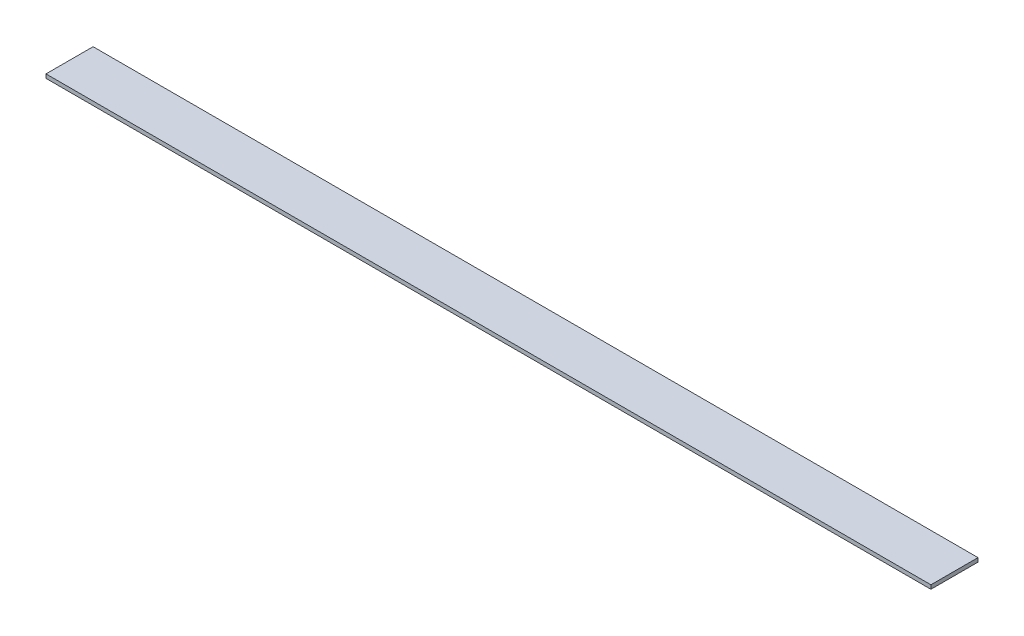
ISO-10303-21;
HEADER;
FILE_DESCRIPTION(('STEP AP214'),'2;1');
FILE_NAME('part.step','',(''),(''),'','','');
FILE_SCHEMA(('AUTOMOTIVE_DESIGN { 1 0 10303 214 1 1 1 1 }'));
ENDSEC;
DATA;
#1=APPLICATION_CONTEXT('core data for automotive mechanical design processes');
#2=APPLICATION_PROTOCOL_DEFINITION('international standard','automotive_design',2000,#1);
#3=PRODUCT_CONTEXT('',#1,'mechanical');
#4=PRODUCT('Part','Part','',(#3));
#5=PRODUCT_RELATED_PRODUCT_CATEGORY('part','',(#4));
#6=PRODUCT_DEFINITION_FORMATION('','',#4);
#7=PRODUCT_DEFINITION_CONTEXT('part definition',#1,'design');
#8=PRODUCT_DEFINITION('design','',#6,#7);
#9=PRODUCT_DEFINITION_SHAPE('','',#8);
#10=(LENGTH_UNIT() NAMED_UNIT(*) SI_UNIT(.MILLI.,.METRE.));
#11=(NAMED_UNIT(*) PLANE_ANGLE_UNIT() SI_UNIT($,.RADIAN.));
#12=(NAMED_UNIT(*) SI_UNIT($,.STERADIAN.) SOLID_ANGLE_UNIT());
#13=UNCERTAINTY_MEASURE_WITH_UNIT(LENGTH_MEASURE(1.E-05),#10,'distance_accuracy_value','');
#14=(GEOMETRIC_REPRESENTATION_CONTEXT(3) GLOBAL_UNCERTAINTY_ASSIGNED_CONTEXT((#13)) GLOBAL_UNIT_ASSIGNED_CONTEXT((#10,
#11,#12)) REPRESENTATION_CONTEXT('',''));
#15=CARTESIAN_POINT('',(0.,0.,0.));
#16=DIRECTION('',(0.,0.,1.));
#17=DIRECTION('',(1.,0.,0.));
#18=AXIS2_PLACEMENT_3D('',#15,#16,#17);
#19=CARTESIAN_POINT('',(715.9625,6.35,-38.1));
#20=DIRECTION('',(-1.,0.,0.));
#21=DIRECTION('',(0.,0.,1.));
#22=AXIS2_PLACEMENT_3D('',#19,#20,#21);
#23=PLANE('',#22);
#24=DIRECTION('',(0.,0.,-1.));
#25=VECTOR('',#24,1.);
#26=CARTESIAN_POINT('',(715.9625,0.,-38.1));
#27=LINE('',#26,#25);
#28=CARTESIAN_POINT('',(715.9625,0.,38.1));
#29=VERTEX_POINT('',#28);
#30=CARTESIAN_POINT('',(715.9625,0.,-38.1));
#31=VERTEX_POINT('',#30);
#32=EDGE_CURVE('E97',#29,#31,#27,.T.);
#33=ORIENTED_EDGE('',*,*,#32,.T.);
#34=DIRECTION('',(0.,-1.,0.));
#35=VECTOR('',#34,1.);
#36=CARTESIAN_POINT('',(715.9625,6.35,-38.1));
#37=LINE('',#36,#35);
#38=CARTESIAN_POINT('',(715.9625,6.35,-38.1));
#39=VERTEX_POINT('',#38);
#40=EDGE_CURVE('E11',#39,#31,#37,.T.);
#41=ORIENTED_EDGE('',*,*,#40,.F.);
#42=DIRECTION('',(0.,0.,-1.));
#43=VECTOR('',#42,1.);
#44=CARTESIAN_POINT('',(715.9625,6.35,-38.1));
#45=LINE('',#44,#43);
#46=CARTESIAN_POINT('',(715.9625,6.35,38.1));
#47=VERTEX_POINT('',#46);
#48=EDGE_CURVE('E85',#47,#39,#45,.T.);
#49=ORIENTED_EDGE('',*,*,#48,.F.);
#50=DIRECTION('',(0.,-1.,0.));
#51=VECTOR('',#50,1.);
#52=CARTESIAN_POINT('',(715.9625,6.35,38.1));
#53=LINE('',#52,#51);
#54=EDGE_CURVE('E93',#47,#29,#53,.T.);
#55=ORIENTED_EDGE('',*,*,#54,.T.);
#56=EDGE_LOOP('',(#33,#41,#49,#55));
#57=FACE_BOUND('',#56,.T.);
#58=ADVANCED_FACE('F34',(#57),#23,.F.);
#59=CARTESIAN_POINT('',(-715.9625,6.35,-38.1));
#60=DIRECTION('',(0.,0.,1.));
#61=DIRECTION('',(1.,0.,0.));
#62=AXIS2_PLACEMENT_3D('',#59,#60,#61);
#63=PLANE('',#62);
#64=DIRECTION('',(-1.,0.,0.));
#65=VECTOR('',#64,1.);
#66=CARTESIAN_POINT('',(-715.9625,0.,-38.1));
#67=LINE('',#66,#65);
#68=CARTESIAN_POINT('',(-715.9625,0.,-38.1));
#69=VERTEX_POINT('',#68);
#70=EDGE_CURVE('E89',#31,#69,#67,.T.);
#71=ORIENTED_EDGE('',*,*,#70,.T.);
#72=DIRECTION('',(0.,-1.,0.));
#73=VECTOR('',#72,1.);
#74=CARTESIAN_POINT('',(-715.9625,6.35,-38.1));
#75=LINE('',#74,#73);
#76=CARTESIAN_POINT('',(-715.9625,6.35,-38.1));
#77=VERTEX_POINT('',#76);
#78=EDGE_CURVE('E42',#77,#69,#75,.T.);
#79=ORIENTED_EDGE('',*,*,#78,.F.);
#80=DIRECTION('',(-1.,0.,0.));
#81=VECTOR('',#80,1.);
#82=CARTESIAN_POINT('',(-715.9625,6.35,-38.1));
#83=LINE('',#82,#81);
#84=EDGE_CURVE('E80',#39,#77,#83,.T.);
#85=ORIENTED_EDGE('',*,*,#84,.F.);
#86=ORIENTED_EDGE('',*,*,#40,.T.);
#87=EDGE_LOOP('',(#71,#79,#85,#86));
#88=FACE_BOUND('',#87,.T.);
#89=ADVANCED_FACE('F88',(#88),#63,.F.);
#90=CARTESIAN_POINT('',(-715.9625,6.35,-38.1));
#91=DIRECTION('',(1.,0.,0.));
#92=DIRECTION('',(0.,0.,-1.));
#93=AXIS2_PLACEMENT_3D('',#90,#91,#92);
#94=PLANE('',#93);
#95=DIRECTION('',(0.,0.,1.));
#96=VECTOR('',#95,1.);
#97=CARTESIAN_POINT('',(-715.9625,0.,-38.1));
#98=LINE('',#97,#96);
#99=CARTESIAN_POINT('',(-715.9625,0.,38.1));
#100=VERTEX_POINT('',#99);
#101=EDGE_CURVE('E67',#69,#100,#98,.T.);
#102=ORIENTED_EDGE('',*,*,#101,.T.);
#103=DIRECTION('',(0.,-1.,0.));
#104=VECTOR('',#103,1.);
#105=CARTESIAN_POINT('',(-715.9625,6.35,38.1));
#106=LINE('',#105,#104);
#107=CARTESIAN_POINT('',(-715.9625,6.35,38.1));
#108=VERTEX_POINT('',#107);
#109=EDGE_CURVE('E90',#108,#100,#106,.T.);
#110=ORIENTED_EDGE('',*,*,#109,.F.);
#111=DIRECTION('',(0.,0.,1.));
#112=VECTOR('',#111,1.);
#113=CARTESIAN_POINT('',(-715.9625,6.35,-38.1));
#114=LINE('',#113,#112);
#115=EDGE_CURVE('E83',#77,#108,#114,.T.);
#116=ORIENTED_EDGE('',*,*,#115,.F.);
#117=ORIENTED_EDGE('',*,*,#78,.T.);
#118=EDGE_LOOP('',(#102,#110,#116,#117));
#119=FACE_BOUND('',#118,.T.);
#120=ADVANCED_FACE('F91',(#119),#94,.F.);
#121=CARTESIAN_POINT('',(-715.9625,6.35,38.1));
#122=DIRECTION('',(0.,0.,-1.));
#123=DIRECTION('',(-1.,0.,0.));
#124=AXIS2_PLACEMENT_3D('',#121,#122,#123);
#125=PLANE('',#124);
#126=DIRECTION('',(1.,0.,0.));
#127=VECTOR('',#126,1.);
#128=CARTESIAN_POINT('',(-715.9625,0.,38.1));
#129=LINE('',#128,#127);
#130=EDGE_CURVE('E73',#100,#29,#129,.T.);
#131=ORIENTED_EDGE('',*,*,#130,.T.);
#132=ORIENTED_EDGE('',*,*,#54,.F.);
#133=DIRECTION('',(1.,0.,0.));
#134=VECTOR('',#133,1.);
#135=CARTESIAN_POINT('',(-715.9625,6.35,38.1));
#136=LINE('',#135,#134);
#137=EDGE_CURVE('E50',#108,#47,#136,.T.);
#138=ORIENTED_EDGE('',*,*,#137,.F.);
#139=ORIENTED_EDGE('',*,*,#109,.T.);
#140=EDGE_LOOP('',(#131,#132,#138,#139));
#141=FACE_BOUND('',#140,.T.);
#142=ADVANCED_FACE('F104',(#141),#125,.F.);
#143=CARTESIAN_POINT('',(715.9625,6.35,38.1));
#144=DIRECTION('',(0.,1.,0.));
#145=DIRECTION('',(0.,0.,1.));
#146=AXIS2_PLACEMENT_3D('',#143,#144,#145);
#147=PLANE('',#146);
#148=ORIENTED_EDGE('',*,*,#48,.T.);
#149=ORIENTED_EDGE('',*,*,#84,.T.);
#150=ORIENTED_EDGE('',*,*,#115,.T.);
#151=ORIENTED_EDGE('',*,*,#137,.T.);
#152=EDGE_LOOP('',(#148,#149,#150,#151));
#153=FACE_BOUND('',#152,.T.);
#154=ADVANCED_FACE('F81',(#153),#147,.T.);
#155=CARTESIAN_POINT('',(715.9625,0.,38.1));
#156=DIRECTION('',(0.,1.,0.));
#157=DIRECTION('',(0.,0.,1.));
#158=AXIS2_PLACEMENT_3D('',#155,#156,#157);
#159=PLANE('',#158);
#160=ORIENTED_EDGE('',*,*,#32,.F.);
#161=ORIENTED_EDGE('',*,*,#130,.F.);
#162=ORIENTED_EDGE('',*,*,#101,.F.);
#163=ORIENTED_EDGE('',*,*,#70,.F.);
#164=EDGE_LOOP('',(#160,#161,#162,#163));
#165=FACE_BOUND('',#164,.T.);
#166=ADVANCED_FACE('F107',(#165),#159,.F.);
#167=CLOSED_SHELL('',(#58,#89,#120,#142,#154,#166));
#168=MANIFOLD_SOLID_BREP('B2',#167);
#169=ADVANCED_BREP_SHAPE_REPRESENTATION('',(#18,#168),#14);
#170=SHAPE_DEFINITION_REPRESENTATION(#9,#169);
ENDSEC;
END-ISO-10303-21;
